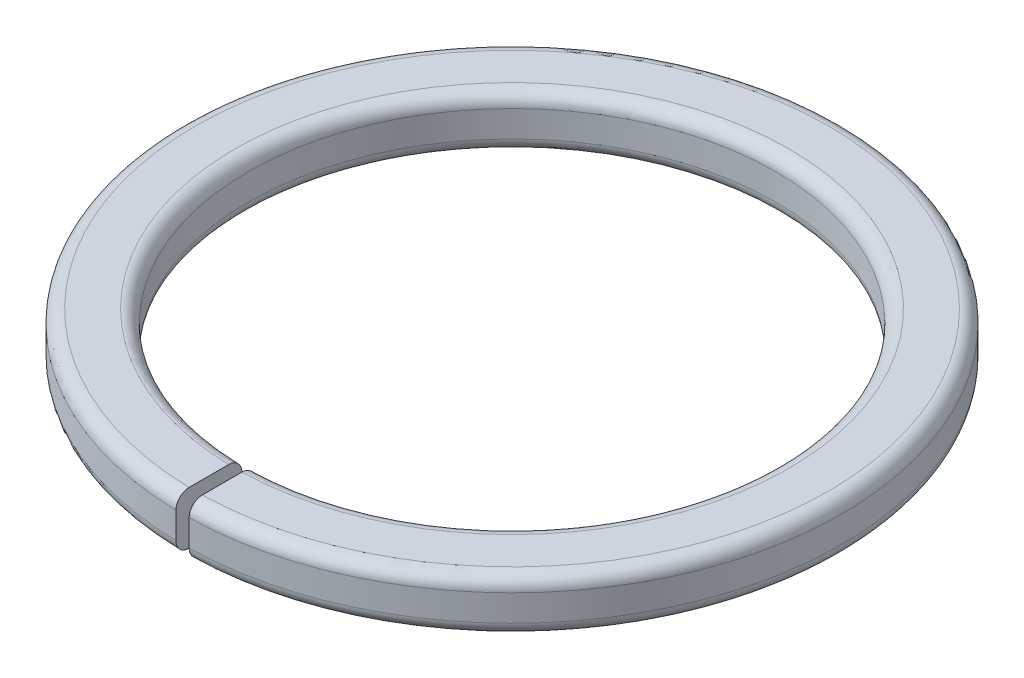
from build123d import *

# Parameters (mm, degrees)
SKETCH1_R          = 5
SKETCH1_R_2        = 4
EXTRUDE1_DEPTH     = 0.8
FILLET2_R          = 0.2
SKETCH2_W          = 0.2
SKETCH2_H          = 9.482423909
CUT_EXTRUDE1_DEPTH = 10


with BuildPart() as part:
    # Sketch1 → Extrude1 (new body)
    with BuildSketch(Plane(origin=(0, 0, 0), x_dir=(1, 0, 0), z_dir=(0, 1, 0))):
        with Locations(Location((0, 0, 0), (0, 0, 270))):
            Circle(SKETCH1_R)
        with Locations(Location((0, 0, 0), (0, 0, 270))):
            Circle(SKETCH1_R_2, mode=Mode.SUBTRACT)
    extrude(amount=EXTRUDE1_DEPTH)

    # Fillet2
    fillet2_edges = [part.edges().sort_by_distance(p)[0] for p in [
        (0, 0, -5),
        (0, 0.8, -5),
        (0, 0, -4),
        (0, 0.8, -4),
    ]]
    fillet(fillet2_edges, radius=FILLET2_R)

    # Sketch2 → Cut-Extrude1 (cut)
    with BuildSketch(Plane(origin=(0, 0.8, 0), x_dir=(-1, 0, 0), z_dir=(0, 1, 0))):
        with Locations((0, 4.741211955)):
            Rectangle(SKETCH2_W, SKETCH2_H)
    extrude(amount=-CUT_EXTRUDE1_DEPTH, mode=Mode.SUBTRACT)


solid = part.part
